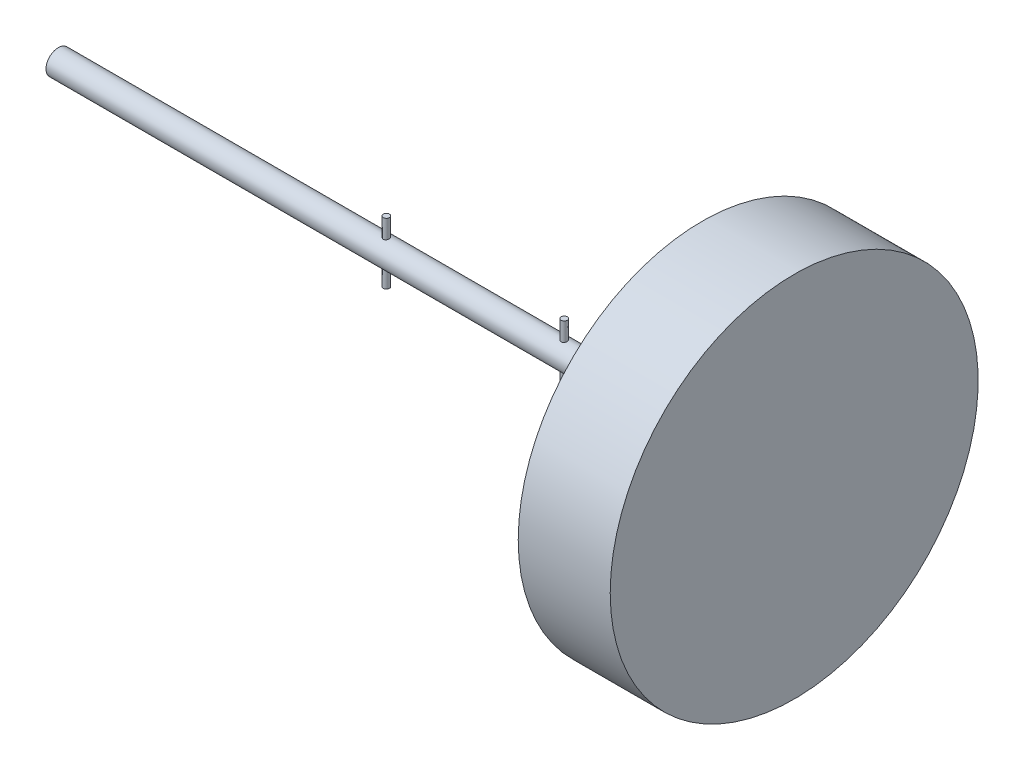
ISO-10303-21;
HEADER;
FILE_DESCRIPTION(('STEP AP214'),'2;1');
FILE_NAME('part.step','',(''),(''),'','','');
FILE_SCHEMA(('AUTOMOTIVE_DESIGN { 1 0 10303 214 1 1 1 1 }'));
ENDSEC;
DATA;
#1=APPLICATION_CONTEXT('core data for automotive mechanical design processes');
#2=APPLICATION_PROTOCOL_DEFINITION('international standard','automotive_design',2000,#1);
#3=PRODUCT_CONTEXT('',#1,'mechanical');
#4=PRODUCT('Part','Part','',(#3));
#5=PRODUCT_RELATED_PRODUCT_CATEGORY('part','',(#4));
#6=PRODUCT_DEFINITION_FORMATION('','',#4);
#7=PRODUCT_DEFINITION_CONTEXT('part definition',#1,'design');
#8=PRODUCT_DEFINITION('design','',#6,#7);
#9=PRODUCT_DEFINITION_SHAPE('','',#8);
#10=(LENGTH_UNIT() NAMED_UNIT(*) SI_UNIT(.MILLI.,.METRE.));
#11=(NAMED_UNIT(*) PLANE_ANGLE_UNIT() SI_UNIT($,.RADIAN.));
#12=(NAMED_UNIT(*) SI_UNIT($,.STERADIAN.) SOLID_ANGLE_UNIT());
#13=UNCERTAINTY_MEASURE_WITH_UNIT(LENGTH_MEASURE(1.E-05),#10,'distance_accuracy_value','');
#14=(GEOMETRIC_REPRESENTATION_CONTEXT(3) GLOBAL_UNCERTAINTY_ASSIGNED_CONTEXT((#13)) GLOBAL_UNIT_ASSIGNED_CONTEXT((#10,
#11,#12)) REPRESENTATION_CONTEXT('',''));
#15=CARTESIAN_POINT('',(0.,0.,0.));
#16=DIRECTION('',(0.,0.,1.));
#17=DIRECTION('',(1.,0.,0.));
#18=AXIS2_PLACEMENT_3D('',#15,#16,#17);
#19=CARTESIAN_POINT('',(-1125.,20.,0.));
#20=DIRECTION('',(1.,0.,0.));
#21=DIRECTION('',(0.,0.,-1.));
#22=AXIS2_PLACEMENT_3D('',#19,#20,#21);
#23=PLANE('',#22);
#24=CARTESIAN_POINT('',(-1125.,0.,0.));
#25=DIRECTION('',(-1.,0.,0.));
#26=DIRECTION('',(0.,0.,1.));
#27=AXIS2_PLACEMENT_3D('',#24,#25,#26);
#28=CIRCLE('',#27,20.);
#29=CARTESIAN_POINT('',(-1125.,0.,20.));
#30=VERTEX_POINT('',#29);
#31=EDGE_CURVE('E105',#30,#30,#28,.T.);
#32=ORIENTED_EDGE('',*,*,#31,.T.);
#33=EDGE_LOOP('',(#32));
#34=FACE_BOUND('',#33,.T.);
#35=ADVANCED_FACE('F28',(#34),#23,.F.);
#36=CARTESIAN_POINT('',(75.,0.,0.));
#37=DIRECTION('',(-1.,0.,0.));
#38=DIRECTION('',(0.,0.,1.));
#39=AXIS2_PLACEMENT_3D('',#36,#37,#38);
#40=PLANE('',#39);
#41=CARTESIAN_POINT('',(75.,0.,0.));
#42=DIRECTION('',(-1.,0.,0.));
#43=DIRECTION('',(0.,0.,1.));
#44=AXIS2_PLACEMENT_3D('',#41,#42,#43);
#45=CIRCLE('',#44,300.);
#46=CARTESIAN_POINT('',(75.,0.,300.));
#47=VERTEX_POINT('',#46);
#48=EDGE_CURVE('E10',#47,#47,#45,.T.);
#49=ORIENTED_EDGE('',*,*,#48,.F.);
#50=EDGE_LOOP('',(#49));
#51=FACE_BOUND('',#50,.T.);
#52=ADVANCED_FACE('F118',(#51),#40,.F.);
#53=CARTESIAN_POINT('',(-1125.,0.,0.));
#54=DIRECTION('',(-1.,0.,0.));
#55=DIRECTION('',(0.,0.,1.));
#56=AXIS2_PLACEMENT_3D('',#53,#54,#55);
#57=CYLINDRICAL_SURFACE('',#56,300.);
#58=CARTESIAN_POINT('',(-75.,0.,0.));
#59=DIRECTION('',(-1.,0.,0.));
#60=DIRECTION('',(0.,0.,1.));
#61=AXIS2_PLACEMENT_3D('',#58,#59,#60);
#62=CIRCLE('',#61,300.);
#63=CARTESIAN_POINT('',(-75.,0.,300.));
#64=VERTEX_POINT('',#63);
#65=EDGE_CURVE('E39',#64,#64,#62,.T.);
#66=ORIENTED_EDGE('',*,*,#65,.F.);
#67=EDGE_LOOP('',(#66));
#68=FACE_BOUND('',#67,.T.);
#69=ORIENTED_EDGE('',*,*,#48,.T.);
#70=EDGE_LOOP('',(#69));
#71=FACE_BOUND('',#70,.T.);
#72=ADVANCED_FACE('F114',(#68,#71),#57,.T.);
#73=CARTESIAN_POINT('',(-75.,300.,0.));
#74=DIRECTION('',(1.,0.,0.));
#75=DIRECTION('',(0.,0.,-1.));
#76=AXIS2_PLACEMENT_3D('',#73,#74,#75);
#77=PLANE('',#76);
#78=CARTESIAN_POINT('',(-75.,0.,0.));
#79=DIRECTION('',(-1.,0.,0.));
#80=DIRECTION('',(0.,0.,1.));
#81=AXIS2_PLACEMENT_3D('',#78,#79,#80);
#82=CIRCLE('',#81,20.0000000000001);
#83=CARTESIAN_POINT('',(-75.,0.,20.0000000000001));
#84=VERTEX_POINT('',#83);
#85=EDGE_CURVE('E44',#84,#84,#82,.T.);
#86=ORIENTED_EDGE('',*,*,#85,.F.);
#87=EDGE_LOOP('',(#86));
#88=FACE_BOUND('',#87,.T.);
#89=ORIENTED_EDGE('',*,*,#65,.T.);
#90=EDGE_LOOP('',(#89));
#91=FACE_BOUND('',#90,.T.);
#92=ADVANCED_FACE('F111',(#88,#91),#77,.F.);
#93=CARTESIAN_POINT('',(-1125.,0.,0.));
#94=DIRECTION('',(-1.,0.,0.));
#95=DIRECTION('',(0.,0.,1.));
#96=AXIS2_PLACEMENT_3D('',#93,#94,#95);
#97=CYLINDRICAL_SURFACE('',#96,20.0000000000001);
#98=CARTESIAN_POINT('',(-300.,-19.3649167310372,4.99999999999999));
#99=CARTESIAN_POINT('',(-299.723898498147,-19.3649220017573,4.99999215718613));
#100=CARTESIAN_POINT('',(-299.447710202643,-19.370886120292,4.97705249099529));
#101=CARTESIAN_POINT('',(-298.903264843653,-19.3940372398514,4.88604625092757));
#102=CARTESIAN_POINT('',(-298.635012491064,-19.4112307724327,4.8179534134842));
#103=CARTESIAN_POINT('',(-298.114392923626,-19.4547744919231,4.63898239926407));
#104=CARTESIAN_POINT('',(-297.862005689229,-19.4811128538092,4.52815945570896));
#105=CARTESIAN_POINT('',(-297.37937829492,-19.5399638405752,4.26704228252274));
#106=CARTESIAN_POINT('',(-297.14913907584,-19.5724767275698,4.11674637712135));
#107=CARTESIAN_POINT('',(-296.712276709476,-19.6408143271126,3.77741685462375));
#108=CARTESIAN_POINT('',(-296.5062127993,-19.6766919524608,3.58767377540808));
#109=CARTESIAN_POINT('',(-296.128477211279,-19.7472575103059,3.17636412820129));
#110=CARTESIAN_POINT('',(-295.956808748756,-19.7819453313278,2.95479458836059));
#111=CARTESIAN_POINT('',(-295.650449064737,-19.8468083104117,2.4822904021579));
#112=CARTESIAN_POINT('',(-295.516307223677,-19.8769137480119,2.23098915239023));
#113=CARTESIAN_POINT('',(-295.292380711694,-19.9286162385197,1.70852636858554));
#114=CARTESIAN_POINT('',(-295.202589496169,-19.950214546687,1.43736777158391));
#115=CARTESIAN_POINT('',(-295.071704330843,-19.9820951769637,0.888717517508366));
#116=CARTESIAN_POINT('',(-295.029660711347,-19.9925978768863,0.611465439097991));
#117=CARTESIAN_POINT('',(-294.992483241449,-20.0018718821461,0.0536576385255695));
#118=CARTESIAN_POINT('',(-294.997342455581,-20.0006449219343,-0.226897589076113));
#119=CARTESIAN_POINT('',(-295.0531497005,-19.9867618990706,-0.776761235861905));
#120=CARTESIAN_POINT('',(-295.103072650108,-19.974360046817,-1.04618107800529));
#121=CARTESIAN_POINT('',(-295.245942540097,-19.9398167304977,-1.57269123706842));
#122=CARTESIAN_POINT('',(-295.338891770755,-19.9176747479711,-1.82978089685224));
#123=CARTESIAN_POINT('',(-295.566005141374,-19.8657501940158,-2.32703351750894));
#124=CARTESIAN_POINT('',(-295.700534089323,-19.8359003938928,-2.56702254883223));
#125=CARTESIAN_POINT('',(-296.006711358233,-19.7717980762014,-3.02137811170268));
#126=CARTESIAN_POINT('',(-296.178366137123,-19.7375447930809,-3.2357401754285));
#127=CARTESIAN_POINT('',(-296.559417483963,-19.6672742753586,-3.63887017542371));
#128=CARTESIAN_POINT('',(-296.769709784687,-19.6312343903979,-3.82678839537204));
#129=CARTESIAN_POINT('',(-297.219199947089,-19.5623008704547,-4.16488187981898));
#130=CARTESIAN_POINT('',(-297.458399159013,-19.5294073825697,-4.31505538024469));
#131=CARTESIAN_POINT('',(-297.960580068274,-19.4704099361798,-4.57394064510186));
#132=CARTESIAN_POINT('',(-298.223671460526,-19.4443396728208,-4.68244783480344));
#133=CARTESIAN_POINT('',(-298.76517093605,-19.4023728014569,-4.85342810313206));
#134=CARTESIAN_POINT('',(-299.043575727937,-19.3864740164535,-4.91591103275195));
#135=CARTESIAN_POINT('',(-299.599919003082,-19.3671071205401,-4.99165927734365));
#136=CARTESIAN_POINT('',(-299.877675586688,-19.3633217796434,-5.00618094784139));
#137=CARTESIAN_POINT('',(-300.431643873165,-19.3677468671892,-4.98903398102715));
#138=CARTESIAN_POINT('',(-300.707855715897,-19.3759561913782,-4.95736959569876));
#139=CARTESIAN_POINT('',(-301.246228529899,-19.403141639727,-4.84985092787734));
#140=CARTESIAN_POINT('',(-301.508545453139,-19.421939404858,-4.77472813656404));
#141=CARTESIAN_POINT('',(-302.016862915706,-19.4680143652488,-4.58323616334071));
#142=CARTESIAN_POINT('',(-302.262861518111,-19.4952925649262,-4.46686209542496));
#143=CARTESIAN_POINT('',(-302.736882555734,-19.5559227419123,-4.19354133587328));
#144=CARTESIAN_POINT('',(-302.964457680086,-19.5893833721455,-4.03584350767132));
#145=CARTESIAN_POINT('',(-303.390376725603,-19.6583416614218,-3.68530146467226));
#146=CARTESIAN_POINT('',(-303.5887158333,-19.6938396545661,-3.4924514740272));
#147=CARTESIAN_POINT('',(-303.955622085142,-19.7639480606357,-3.07131360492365));
#148=CARTESIAN_POINT('',(-304.123320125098,-19.7985140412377,-2.84225976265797));
#149=CARTESIAN_POINT('',(-304.417871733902,-19.8619443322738,-2.35851341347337));
#150=CARTESIAN_POINT('',(-304.544727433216,-19.890808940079,-2.10382224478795));
#151=CARTESIAN_POINT('',(-304.752892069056,-19.9394023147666,-1.57779100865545));
#152=CARTESIAN_POINT('',(-304.834528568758,-19.9591966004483,-1.30658690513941));
#153=CARTESIAN_POINT('',(-304.950920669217,-19.9877058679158,-0.753748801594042));
#154=CARTESIAN_POINT('',(-304.985685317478,-19.9964229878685,-0.472116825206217));
#155=CARTESIAN_POINT('',(-305.006837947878,-20.0017084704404,0.0854176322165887));
#156=CARTESIAN_POINT('',(-304.994508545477,-19.9985989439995,0.361269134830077));
#157=CARTESIAN_POINT('',(-304.924760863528,-19.9812948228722,0.906837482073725));
#158=CARTESIAN_POINT('',(-304.867343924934,-19.9671005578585,1.17655450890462));
#159=CARTESIAN_POINT('',(-304.709738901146,-19.9292716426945,1.70085517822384));
#160=CARTESIAN_POINT('',(-304.609782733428,-19.9056882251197,1.95551247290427));
#161=CARTESIAN_POINT('',(-304.370147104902,-19.851564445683,2.44458526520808));
#162=CARTESIAN_POINT('',(-304.230462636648,-19.8210232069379,2.67899820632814));
#163=CARTESIAN_POINT('',(-303.911423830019,-19.7553624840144,3.12700964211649));
#164=CARTESIAN_POINT('',(-303.731199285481,-19.7201508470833,3.33997494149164));
#165=CARTESIAN_POINT('',(-303.337885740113,-19.6495324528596,3.73307510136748));
#166=CARTESIAN_POINT('',(-303.124788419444,-19.6141256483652,3.91320162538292));
#167=CARTESIAN_POINT('',(-302.666992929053,-19.5463737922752,4.23881013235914));
#168=CARTESIAN_POINT('',(-302.421779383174,-19.5140981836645,4.38358309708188));
#169=CARTESIAN_POINT('',(-301.909722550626,-19.4571977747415,4.62963448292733));
#170=CARTESIAN_POINT('',(-301.642895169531,-19.4325674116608,4.73094454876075));
#171=CARTESIAN_POINT('',(-301.147114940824,-19.3975954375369,4.872112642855));
#172=CARTESIAN_POINT('',(-300.920534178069,-19.385433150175,4.91996585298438));
#173=CARTESIAN_POINT('',(-300.462655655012,-19.3690919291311,4.98391146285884));
#174=CARTESIAN_POINT('',(-300.231358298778,-19.3649123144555,5.00000657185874));
#175=CARTESIAN_POINT('',(-300.,-19.3649167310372,4.99999999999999));
#176=B_SPLINE_CURVE_WITH_KNOTS('',3,(#98,#99,#100,#101,#102,#103,#104,#105,#106,#107,#108,#109,
#110,#111,#112,#113,#114,#115,#116,#117,#118,#119,#120,#121,#122,#123,#124,#125,#126,#127,#128,
#129,#130,#131,#132,#133,#134,#135,#136,#137,#138,#139,#140,#141,#142,#143,#144,#145,#146,#147,
#148,#149,#150,#151,#152,#153,#154,#155,#156,#157,#158,#159,#160,#161,#162,#163,#164,#165,#166,
#167,#168,#169,#170,#171,#172,#173,#174,#175),.UNSPECIFIED.,.T.,.F.,(4,2,2,2,2,2,2,2,2,2,2,2,2,
2,2,2,2,2,2,2,2,2,2,2,2,2,2,2,2,2,2,2,2,2,2,2,2,2,4),(0.,0.827454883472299,1.65539148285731,
2.4822614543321,3.30916653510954,4.15247908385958,4.99587042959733,5.85102992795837,
6.70606319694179,7.54377501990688,8.38136297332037,9.2003652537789,10.0194111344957,
10.8458574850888,11.6724477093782,12.5214093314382,13.370410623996,14.2235286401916,
15.0764640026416,15.9068714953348,16.7372025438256,17.5539481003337,18.3707904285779,
19.2036569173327,20.0366603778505,20.8905066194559,21.7443083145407,22.5918414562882,
23.4392109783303,24.2636689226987,25.0881023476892,25.9080975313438,26.728196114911,
27.567941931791,28.4079006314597,29.2635295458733,30.118534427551,30.8119565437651,
31.505319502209),.UNSPECIFIED.);
#177=CARTESIAN_POINT('',(-300.,-19.3649167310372,4.99999999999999));
#178=VERTEX_POINT('',#177);
#179=EDGE_CURVE('E31',#178,#178,#176,.T.);
#180=ORIENTED_EDGE('',*,*,#179,.T.);
#181=EDGE_LOOP('',(#180));
#182=FACE_BOUND('',#181,.T.);
#183=CARTESIAN_POINT('',(-300.,19.3649167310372,4.99999999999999));
#184=CARTESIAN_POINT('',(-300.276101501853,19.3649220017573,4.99999215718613));
#185=CARTESIAN_POINT('',(-300.552289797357,19.370886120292,4.97705249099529));
#186=CARTESIAN_POINT('',(-301.096735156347,19.3940372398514,4.88604625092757));
#187=CARTESIAN_POINT('',(-301.364987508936,19.4112307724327,4.8179534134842));
#188=CARTESIAN_POINT('',(-301.885607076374,19.4547744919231,4.63898239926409));
#189=CARTESIAN_POINT('',(-302.137994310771,19.4811128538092,4.52815945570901));
#190=CARTESIAN_POINT('',(-302.62062170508,19.5399638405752,4.26704228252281));
#191=CARTESIAN_POINT('',(-302.85086092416,19.5724767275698,4.1167463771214));
#192=CARTESIAN_POINT('',(-303.287723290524,19.6408143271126,3.77741685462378));
#193=CARTESIAN_POINT('',(-303.4937872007,19.6766919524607,3.58767377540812));
#194=CARTESIAN_POINT('',(-303.871522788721,19.7472575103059,3.17636412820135));
#195=CARTESIAN_POINT('',(-304.043191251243,19.7819453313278,2.95479458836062));
#196=CARTESIAN_POINT('',(-304.349550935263,19.8468083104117,2.4822904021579));
#197=CARTESIAN_POINT('',(-304.483692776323,19.8769137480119,2.23098915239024));
#198=CARTESIAN_POINT('',(-304.707619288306,19.9286162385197,1.70852636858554));
#199=CARTESIAN_POINT('',(-304.797410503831,19.950214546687,1.43736777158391));
#200=CARTESIAN_POINT('',(-304.928295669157,19.9820951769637,0.888717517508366));
#201=CARTESIAN_POINT('',(-304.970339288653,19.9925978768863,0.611465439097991));
#202=CARTESIAN_POINT('',(-305.007516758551,20.0018718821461,0.0536576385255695));
#203=CARTESIAN_POINT('',(-305.002657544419,20.0006449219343,-0.226897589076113));
#204=CARTESIAN_POINT('',(-304.9468502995,19.9867618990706,-0.776761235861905));
#205=CARTESIAN_POINT('',(-304.896927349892,19.974360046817,-1.04618107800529));
#206=CARTESIAN_POINT('',(-304.754057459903,19.9398167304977,-1.57269123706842));
#207=CARTESIAN_POINT('',(-304.661108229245,19.9176747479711,-1.82978089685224));
#208=CARTESIAN_POINT('',(-304.433994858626,19.8657501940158,-2.32703351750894));
#209=CARTESIAN_POINT('',(-304.299465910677,19.8359003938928,-2.56702254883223));
#210=CARTESIAN_POINT('',(-303.993288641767,19.7717980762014,-3.02137811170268));
#211=CARTESIAN_POINT('',(-303.821633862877,19.7375447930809,-3.2357401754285));
#212=CARTESIAN_POINT('',(-303.440582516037,19.6672742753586,-3.63887017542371));
#213=CARTESIAN_POINT('',(-303.230290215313,19.6312343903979,-3.82678839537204));
#214=CARTESIAN_POINT('',(-302.780800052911,19.5623008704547,-4.16488187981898));
#215=CARTESIAN_POINT('',(-302.541600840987,19.5294073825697,-4.31505538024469));
#216=CARTESIAN_POINT('',(-302.039419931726,19.4704099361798,-4.57394064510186));
#217=CARTESIAN_POINT('',(-301.776328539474,19.4443396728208,-4.68244783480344));
#218=CARTESIAN_POINT('',(-301.23482906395,19.4023728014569,-4.85342810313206));
#219=CARTESIAN_POINT('',(-300.956424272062,19.3864740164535,-4.91591103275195));
#220=CARTESIAN_POINT('',(-300.400080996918,19.3671071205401,-4.99165927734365));
#221=CARTESIAN_POINT('',(-300.122324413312,19.3633217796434,-5.00618094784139));
#222=CARTESIAN_POINT('',(-299.568356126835,19.3677468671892,-4.98903398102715));
#223=CARTESIAN_POINT('',(-299.292144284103,19.3759561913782,-4.95736959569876));
#224=CARTESIAN_POINT('',(-298.753771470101,19.403141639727,-4.84985092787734));
#225=CARTESIAN_POINT('',(-298.491454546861,19.421939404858,-4.77472813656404));
#226=CARTESIAN_POINT('',(-297.983137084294,19.4680143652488,-4.58323616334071));
#227=CARTESIAN_POINT('',(-297.737138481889,19.4952925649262,-4.46686209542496));
#228=CARTESIAN_POINT('',(-297.263117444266,19.5559227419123,-4.19354133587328));
#229=CARTESIAN_POINT('',(-297.035542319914,19.5893833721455,-4.03584350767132));
#230=CARTESIAN_POINT('',(-296.609623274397,19.6583416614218,-3.68530146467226));
#231=CARTESIAN_POINT('',(-296.4112841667,19.6938396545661,-3.4924514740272));
#232=CARTESIAN_POINT('',(-296.044377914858,19.7639480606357,-3.07131360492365));
#233=CARTESIAN_POINT('',(-295.876679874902,19.7985140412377,-2.84225976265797));
#234=CARTESIAN_POINT('',(-295.582128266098,19.8619443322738,-2.35851341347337));
#235=CARTESIAN_POINT('',(-295.455272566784,19.890808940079,-2.10382224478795));
#236=CARTESIAN_POINT('',(-295.247107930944,19.9394023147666,-1.57779100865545));
#237=CARTESIAN_POINT('',(-295.165471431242,19.9591966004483,-1.30658690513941));
#238=CARTESIAN_POINT('',(-295.049079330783,19.9877058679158,-0.753748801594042));
#239=CARTESIAN_POINT('',(-295.014314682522,19.9964229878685,-0.472116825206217));
#240=CARTESIAN_POINT('',(-294.993162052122,20.0017084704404,0.0854176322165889));
#241=CARTESIAN_POINT('',(-295.005491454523,19.9985989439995,0.361269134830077));
#242=CARTESIAN_POINT('',(-295.075239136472,19.9812948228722,0.906837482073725));
#243=CARTESIAN_POINT('',(-295.132656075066,19.9671005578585,1.17655450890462));
#244=CARTESIAN_POINT('',(-295.290261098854,19.9292716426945,1.70085517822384));
#245=CARTESIAN_POINT('',(-295.390217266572,19.9056882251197,1.95551247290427));
#246=CARTESIAN_POINT('',(-295.629852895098,19.851564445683,2.44458526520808));
#247=CARTESIAN_POINT('',(-295.769537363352,19.8210232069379,2.67899820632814));
#248=CARTESIAN_POINT('',(-296.088576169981,19.7553624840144,3.12700964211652));
#249=CARTESIAN_POINT('',(-296.268800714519,19.7201508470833,3.3399749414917));
#250=CARTESIAN_POINT('',(-296.662114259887,19.6495324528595,3.73307510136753));
#251=CARTESIAN_POINT('',(-296.875211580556,19.6141256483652,3.91320162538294));
#252=CARTESIAN_POINT('',(-297.333007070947,19.5463737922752,4.23881013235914));
#253=CARTESIAN_POINT('',(-297.578220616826,19.5140981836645,4.38358309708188));
#254=CARTESIAN_POINT('',(-298.090277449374,19.4571977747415,4.62963448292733));
#255=CARTESIAN_POINT('',(-298.357104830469,19.4325674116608,4.73094454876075));
#256=CARTESIAN_POINT('',(-298.852885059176,19.3975954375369,4.872112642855));
#257=CARTESIAN_POINT('',(-299.079465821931,19.385433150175,4.91996585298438));
#258=CARTESIAN_POINT('',(-299.537344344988,19.3690919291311,4.98391146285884));
#259=CARTESIAN_POINT('',(-299.768641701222,19.3649123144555,5.00000657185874));
#260=CARTESIAN_POINT('',(-300.,19.3649167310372,4.99999999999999));
#261=B_SPLINE_CURVE_WITH_KNOTS('',3,(#183,#184,#185,#186,#187,#188,#189,#190,#191,#192,#193,
#194,#195,#196,#197,#198,#199,#200,#201,#202,#203,#204,#205,#206,#207,#208,#209,#210,#211,#212,
#213,#214,#215,#216,#217,#218,#219,#220,#221,#222,#223,#224,#225,#226,#227,#228,#229,#230,#231,
#232,#233,#234,#235,#236,#237,#238,#239,#240,#241,#242,#243,#244,#245,#246,#247,#248,#249,#250,
#251,#252,#253,#254,#255,#256,#257,#258,#259,#260),.UNSPECIFIED.,.T.,.F.,(4,2,2,2,2,2,2,2,2,2,2,
2,2,2,2,2,2,2,2,2,2,2,2,2,2,2,2,2,2,2,2,2,2,2,2,2,2,2,4),(0.,0.827454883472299,1.65539148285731,
2.48226145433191,3.30916653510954,4.15247908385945,4.99587042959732,5.85102992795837,
6.70606319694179,7.54377501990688,8.38136297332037,9.2003652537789,10.0194111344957,
10.8458574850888,11.6724477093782,12.5214093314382,13.370410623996,14.2235286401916,
15.0764640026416,15.9068714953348,16.7372025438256,17.5539481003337,18.3707904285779,
19.2036569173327,20.0366603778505,20.8905066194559,21.7443083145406,22.5918414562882,
23.4392109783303,24.2636689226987,25.0881023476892,25.9080975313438,26.728196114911,
27.5679419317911,28.4079006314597,29.2635295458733,30.118534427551,30.8119565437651,
31.505319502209),.UNSPECIFIED.);
#262=CARTESIAN_POINT('',(-300.,19.3649167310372,4.99999999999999));
#263=VERTEX_POINT('',#262);
#264=EDGE_CURVE('E85',#263,#263,#261,.T.);
#265=ORIENTED_EDGE('',*,*,#264,.T.);
#266=EDGE_LOOP('',(#265));
#267=FACE_BOUND('',#266,.T.);
#268=CARTESIAN_POINT('',(-590.,-19.3649167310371,5.00000000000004));
#269=CARTESIAN_POINT('',(-589.723898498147,-19.3649220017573,4.99999215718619));
#270=CARTESIAN_POINT('',(-589.447710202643,-19.370886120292,4.97705249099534));
#271=CARTESIAN_POINT('',(-588.903264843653,-19.3940372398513,4.88604625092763));
#272=CARTESIAN_POINT('',(-588.635012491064,-19.4112307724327,4.81795341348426));
#273=CARTESIAN_POINT('',(-588.114392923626,-19.4547744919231,4.63898239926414));
#274=CARTESIAN_POINT('',(-587.862005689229,-19.4811128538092,4.52815945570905));
#275=CARTESIAN_POINT('',(-587.37937829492,-19.5399638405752,4.26704228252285));
#276=CARTESIAN_POINT('',(-587.14913907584,-19.5724767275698,4.11674637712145));
#277=CARTESIAN_POINT('',(-586.712276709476,-19.6408143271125,3.77741685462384));
#278=CARTESIAN_POINT('',(-586.5062127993,-19.6766919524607,3.58767377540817));
#279=CARTESIAN_POINT('',(-586.128477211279,-19.7472575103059,3.1763641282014));
#280=CARTESIAN_POINT('',(-585.956808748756,-19.7819453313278,2.9547945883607));
#281=CARTESIAN_POINT('',(-585.650449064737,-19.8468083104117,2.482290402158));
#282=CARTESIAN_POINT('',(-585.516307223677,-19.8769137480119,2.23098915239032));
#283=CARTESIAN_POINT('',(-585.292380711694,-19.9286162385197,1.7085263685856));
#284=CARTESIAN_POINT('',(-585.202589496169,-19.950214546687,1.43736777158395));
#285=CARTESIAN_POINT('',(-585.071704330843,-19.9820951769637,0.888717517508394));
#286=CARTESIAN_POINT('',(-585.029660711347,-19.9925978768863,0.611465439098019));
#287=CARTESIAN_POINT('',(-584.992483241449,-20.0018718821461,0.0536576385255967));
#288=CARTESIAN_POINT('',(-584.997342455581,-20.0006449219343,-0.226897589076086));
#289=CARTESIAN_POINT('',(-585.0531497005,-19.9867618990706,-0.776761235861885));
#290=CARTESIAN_POINT('',(-585.103072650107,-19.974360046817,-1.04618107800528));
#291=CARTESIAN_POINT('',(-585.245942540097,-19.9398167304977,-1.57269123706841));
#292=CARTESIAN_POINT('',(-585.338891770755,-19.9176747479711,-1.82978089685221));
#293=CARTESIAN_POINT('',(-585.566005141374,-19.8657501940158,-2.32703351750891));
#294=CARTESIAN_POINT('',(-585.700534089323,-19.8359003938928,-2.56702254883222));
#295=CARTESIAN_POINT('',(-586.006711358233,-19.7717980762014,-3.02137811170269));
#296=CARTESIAN_POINT('',(-586.178366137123,-19.7375447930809,-3.23574017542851));
#297=CARTESIAN_POINT('',(-586.559417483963,-19.6672742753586,-3.63887017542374));
#298=CARTESIAN_POINT('',(-586.769709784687,-19.6312343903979,-3.8267883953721));
#299=CARTESIAN_POINT('',(-587.219199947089,-19.5623008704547,-4.16488187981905));
#300=CARTESIAN_POINT('',(-587.458399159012,-19.5294073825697,-4.31505538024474));
#301=CARTESIAN_POINT('',(-587.960580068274,-19.4704099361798,-4.57394064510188));
#302=CARTESIAN_POINT('',(-588.223671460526,-19.4443396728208,-4.68244783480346));
#303=CARTESIAN_POINT('',(-588.76517093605,-19.4023728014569,-4.85342810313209));
#304=CARTESIAN_POINT('',(-589.043575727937,-19.3864740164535,-4.915911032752));
#305=CARTESIAN_POINT('',(-589.599919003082,-19.3671071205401,-4.9916592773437));
#306=CARTESIAN_POINT('',(-589.877675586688,-19.3633217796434,-5.00618094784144));
#307=CARTESIAN_POINT('',(-590.431643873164,-19.3677468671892,-4.98903398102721));
#308=CARTESIAN_POINT('',(-590.707855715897,-19.3759561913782,-4.95736959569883));
#309=CARTESIAN_POINT('',(-591.246228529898,-19.403141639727,-4.84985092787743));
#310=CARTESIAN_POINT('',(-591.508545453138,-19.421939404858,-4.77472813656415));
#311=CARTESIAN_POINT('',(-592.016862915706,-19.4680143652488,-4.58323616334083));
#312=CARTESIAN_POINT('',(-592.262861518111,-19.4952925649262,-4.46686209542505));
#313=CARTESIAN_POINT('',(-592.736882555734,-19.5559227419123,-4.19354133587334));
#314=CARTESIAN_POINT('',(-592.964457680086,-19.5893833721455,-4.03584350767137));
#315=CARTESIAN_POINT('',(-593.390376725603,-19.6583416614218,-3.68530146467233));
#316=CARTESIAN_POINT('',(-593.5887158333,-19.693839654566,-3.49245147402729));
#317=CARTESIAN_POINT('',(-593.955622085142,-19.7639480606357,-3.07131360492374));
#318=CARTESIAN_POINT('',(-594.123320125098,-19.7985140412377,-2.84225976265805));
#319=CARTESIAN_POINT('',(-594.417871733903,-19.8619443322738,-2.35851341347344));
#320=CARTESIAN_POINT('',(-594.544727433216,-19.890808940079,-2.10382224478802));
#321=CARTESIAN_POINT('',(-594.752892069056,-19.9394023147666,-1.57779100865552));
#322=CARTESIAN_POINT('',(-594.834528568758,-19.9591966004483,-1.30658690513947));
#323=CARTESIAN_POINT('',(-594.950920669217,-19.9877058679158,-0.753748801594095));
#324=CARTESIAN_POINT('',(-594.985685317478,-19.9964229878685,-0.472116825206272));
#325=CARTESIAN_POINT('',(-595.006837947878,-20.0017084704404,0.0854176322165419));
#326=CARTESIAN_POINT('',(-594.994508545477,-19.9985989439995,0.361269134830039));
#327=CARTESIAN_POINT('',(-594.924760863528,-19.9812948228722,0.90683748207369));
#328=CARTESIAN_POINT('',(-594.867343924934,-19.9671005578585,1.17655450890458));
#329=CARTESIAN_POINT('',(-594.709738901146,-19.9292716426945,1.70085517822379));
#330=CARTESIAN_POINT('',(-594.609782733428,-19.9056882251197,1.95551247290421));
#331=CARTESIAN_POINT('',(-594.370147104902,-19.851564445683,2.44458526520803));
#332=CARTESIAN_POINT('',(-594.230462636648,-19.821023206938,2.67899820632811));
#333=CARTESIAN_POINT('',(-593.911423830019,-19.7553624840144,3.12700964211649));
#334=CARTESIAN_POINT('',(-593.731199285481,-19.7201508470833,3.33997494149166));
#335=CARTESIAN_POINT('',(-593.337885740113,-19.6495324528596,3.7330751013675));
#336=CARTESIAN_POINT('',(-593.124788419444,-19.6141256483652,3.91320162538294));
#337=CARTESIAN_POINT('',(-592.666992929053,-19.5463737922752,4.23881013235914));
#338=CARTESIAN_POINT('',(-592.421779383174,-19.5140981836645,4.38358309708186));
#339=CARTESIAN_POINT('',(-591.909722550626,-19.4571977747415,4.62963448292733));
#340=CARTESIAN_POINT('',(-591.642895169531,-19.4325674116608,4.73094454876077));
#341=CARTESIAN_POINT('',(-591.147114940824,-19.3975954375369,4.87211264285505));
#342=CARTESIAN_POINT('',(-590.920534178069,-19.385433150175,4.91996585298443));
#343=CARTESIAN_POINT('',(-590.462655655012,-19.3690919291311,4.98391146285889));
#344=CARTESIAN_POINT('',(-590.231358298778,-19.3649123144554,5.0000065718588));
#345=CARTESIAN_POINT('',(-590.,-19.3649167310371,5.00000000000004));
#346=B_SPLINE_CURVE_WITH_KNOTS('',3,(#268,#269,#270,#271,#272,#273,#274,#275,#276,#277,#278,
#279,#280,#281,#282,#283,#284,#285,#286,#287,#288,#289,#290,#291,#292,#293,#294,#295,#296,#297,
#298,#299,#300,#301,#302,#303,#304,#305,#306,#307,#308,#309,#310,#311,#312,#313,#314,#315,#316,
#317,#318,#319,#320,#321,#322,#323,#324,#325,#326,#327,#328,#329,#330,#331,#332,#333,#334,#335,
#336,#337,#338,#339,#340,#341,#342,#343,#344,#345),.UNSPECIFIED.,.T.,.F.,(4,2,2,2,2,2,2,2,2,2,2,
2,2,2,2,2,2,2,2,2,2,2,2,2,2,2,2,2,2,2,2,2,2,2,2,2,2,2,4),(0.,0.827454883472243,1.65539148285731,
2.48226145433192,3.30916653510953,4.1524790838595,4.99587042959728,5.8510299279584,
6.70606319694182,7.54377501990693,8.38136297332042,9.20036525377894,10.0194111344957,
10.8458574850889,11.6724477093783,12.5214093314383,13.3704106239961,14.2235286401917,
15.0764640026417,15.9068714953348,16.7372025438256,17.5539481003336,18.370790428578,
19.2036569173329,20.0366603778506,20.8905066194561,21.7443083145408,22.5918414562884,
23.4392109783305,24.2636689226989,25.0881023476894,25.9080975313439,26.7281961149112,
27.5679419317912,28.40790063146,29.2635295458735,30.1185344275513,30.8119565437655,
31.5053195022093),.UNSPECIFIED.);
#347=CARTESIAN_POINT('',(-590.,-19.3649167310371,5.00000000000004));
#348=VERTEX_POINT('',#347);
#349=EDGE_CURVE('E54',#348,#348,#346,.T.);
#350=ORIENTED_EDGE('',*,*,#349,.T.);
#351=EDGE_LOOP('',(#350));
#352=FACE_BOUND('',#351,.T.);
#353=CARTESIAN_POINT('',(-590.,19.3649167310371,5.00000000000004));
#354=CARTESIAN_POINT('',(-590.276101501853,19.3649220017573,4.99999215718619));
#355=CARTESIAN_POINT('',(-590.552289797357,19.370886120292,4.97705249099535));
#356=CARTESIAN_POINT('',(-591.096735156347,19.3940372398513,4.88604625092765));
#357=CARTESIAN_POINT('',(-591.364987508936,19.4112307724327,4.81795341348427));
#358=CARTESIAN_POINT('',(-591.885607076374,19.4547744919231,4.63898239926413));
#359=CARTESIAN_POINT('',(-592.137994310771,19.4811128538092,4.52815945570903));
#360=CARTESIAN_POINT('',(-592.62062170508,19.5399638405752,4.26704228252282));
#361=CARTESIAN_POINT('',(-592.85086092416,19.5724767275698,4.11674637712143));
#362=CARTESIAN_POINT('',(-593.287723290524,19.6408143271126,3.77741685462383));
#363=CARTESIAN_POINT('',(-593.4937872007,19.6766919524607,3.58767377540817));
#364=CARTESIAN_POINT('',(-593.871522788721,19.7472575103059,3.1763641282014));
#365=CARTESIAN_POINT('',(-594.043191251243,19.7819453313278,2.9547945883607));
#366=CARTESIAN_POINT('',(-594.349550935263,19.8468083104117,2.48229040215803));
#367=CARTESIAN_POINT('',(-594.483692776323,19.8769137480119,2.23098915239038));
#368=CARTESIAN_POINT('',(-594.707619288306,19.9286162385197,1.70852636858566));
#369=CARTESIAN_POINT('',(-594.797410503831,19.950214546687,1.43736777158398));
#370=CARTESIAN_POINT('',(-594.928295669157,19.9820951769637,0.888717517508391));
#371=CARTESIAN_POINT('',(-594.970339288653,19.9925978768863,0.611465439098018));
#372=CARTESIAN_POINT('',(-595.007516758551,20.0018718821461,0.0536576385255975));
#373=CARTESIAN_POINT('',(-595.002657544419,20.0006449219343,-0.226897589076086));
#374=CARTESIAN_POINT('',(-594.9468502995,19.9867618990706,-0.776761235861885));
#375=CARTESIAN_POINT('',(-594.896927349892,19.974360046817,-1.04618107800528));
#376=CARTESIAN_POINT('',(-594.754057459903,19.9398167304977,-1.57269123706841));
#377=CARTESIAN_POINT('',(-594.661108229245,19.9176747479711,-1.82978089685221));
#378=CARTESIAN_POINT('',(-594.433994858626,19.8657501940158,-2.32703351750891));
#379=CARTESIAN_POINT('',(-594.299465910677,19.8359003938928,-2.56702254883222));
#380=CARTESIAN_POINT('',(-593.993288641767,19.7717980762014,-3.02137811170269));
#381=CARTESIAN_POINT('',(-593.821633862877,19.7375447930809,-3.23574017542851));
#382=CARTESIAN_POINT('',(-593.440582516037,19.6672742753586,-3.63887017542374));
#383=CARTESIAN_POINT('',(-593.230290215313,19.6312343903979,-3.8267883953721));
#384=CARTESIAN_POINT('',(-592.780800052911,19.5623008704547,-4.16488187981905));
#385=CARTESIAN_POINT('',(-592.541600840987,19.5294073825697,-4.31505538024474));
#386=CARTESIAN_POINT('',(-592.039419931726,19.4704099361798,-4.57394064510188));
#387=CARTESIAN_POINT('',(-591.776328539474,19.4443396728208,-4.68244783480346));
#388=CARTESIAN_POINT('',(-591.23482906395,19.4023728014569,-4.85342810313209));
#389=CARTESIAN_POINT('',(-590.956424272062,19.3864740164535,-4.915911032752));
#390=CARTESIAN_POINT('',(-590.400080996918,19.3671071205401,-4.9916592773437));
#391=CARTESIAN_POINT('',(-590.122324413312,19.3633217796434,-5.00618094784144));
#392=CARTESIAN_POINT('',(-589.568356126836,19.3677468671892,-4.98903398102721));
#393=CARTESIAN_POINT('',(-589.292144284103,19.3759561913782,-4.95736959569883));
#394=CARTESIAN_POINT('',(-588.753771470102,19.403141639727,-4.84985092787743));
#395=CARTESIAN_POINT('',(-588.491454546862,19.421939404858,-4.77472813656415));
#396=CARTESIAN_POINT('',(-587.983137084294,19.4680143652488,-4.58323616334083));
#397=CARTESIAN_POINT('',(-587.737138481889,19.4952925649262,-4.46686209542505));
#398=CARTESIAN_POINT('',(-587.263117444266,19.5559227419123,-4.19354133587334));
#399=CARTESIAN_POINT('',(-587.035542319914,19.5893833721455,-4.03584350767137));
#400=CARTESIAN_POINT('',(-586.609623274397,19.6583416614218,-3.68530146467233));
#401=CARTESIAN_POINT('',(-586.4112841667,19.693839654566,-3.49245147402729));
#402=CARTESIAN_POINT('',(-586.044377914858,19.7639480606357,-3.07131360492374));
#403=CARTESIAN_POINT('',(-585.876679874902,19.7985140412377,-2.84225976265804));
#404=CARTESIAN_POINT('',(-585.582128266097,19.8619443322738,-2.35851341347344));
#405=CARTESIAN_POINT('',(-585.455272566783,19.890808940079,-2.10382224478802));
#406=CARTESIAN_POINT('',(-585.247107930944,19.9394023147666,-1.57779100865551));
#407=CARTESIAN_POINT('',(-585.165471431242,19.9591966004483,-1.30658690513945));
#408=CARTESIAN_POINT('',(-585.049079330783,19.9877058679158,-0.753748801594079));
#409=CARTESIAN_POINT('',(-585.014314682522,19.9964229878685,-0.472116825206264));
#410=CARTESIAN_POINT('',(-584.993162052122,20.0017084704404,0.0854176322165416));
#411=CARTESIAN_POINT('',(-585.005491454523,19.9985989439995,0.361269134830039));
#412=CARTESIAN_POINT('',(-585.075239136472,19.9812948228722,0.90683748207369));
#413=CARTESIAN_POINT('',(-585.132656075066,19.9671005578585,1.17655450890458));
#414=CARTESIAN_POINT('',(-585.290261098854,19.9292716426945,1.70085517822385));
#415=CARTESIAN_POINT('',(-585.390217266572,19.9056882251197,1.95551247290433));
#416=CARTESIAN_POINT('',(-585.629852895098,19.851564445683,2.44458526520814));
#417=CARTESIAN_POINT('',(-585.769537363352,19.8210232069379,2.67899820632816));
#418=CARTESIAN_POINT('',(-586.088576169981,19.7553624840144,3.12700964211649));
#419=CARTESIAN_POINT('',(-586.268800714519,19.7201508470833,3.33997494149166));
#420=CARTESIAN_POINT('',(-586.662114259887,19.6495324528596,3.7330751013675));
#421=CARTESIAN_POINT('',(-586.875211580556,19.6141256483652,3.91320162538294));
#422=CARTESIAN_POINT('',(-587.333007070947,19.5463737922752,4.23881013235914));
#423=CARTESIAN_POINT('',(-587.578220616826,19.5140981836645,4.38358309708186));
#424=CARTESIAN_POINT('',(-588.090277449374,19.4571977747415,4.62963448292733));
#425=CARTESIAN_POINT('',(-588.357104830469,19.4325674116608,4.73094454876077));
#426=CARTESIAN_POINT('',(-588.852885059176,19.3975954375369,4.87211264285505));
#427=CARTESIAN_POINT('',(-589.079465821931,19.385433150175,4.91996585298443));
#428=CARTESIAN_POINT('',(-589.537344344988,19.3690919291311,4.98391146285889));
#429=CARTESIAN_POINT('',(-589.768641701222,19.3649123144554,5.0000065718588));
#430=CARTESIAN_POINT('',(-590.,19.3649167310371,5.00000000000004));
#431=B_SPLINE_CURVE_WITH_KNOTS('',3,(#353,#354,#355,#356,#357,#358,#359,#360,#361,#362,#363,
#364,#365,#366,#367,#368,#369,#370,#371,#372,#373,#374,#375,#376,#377,#378,#379,#380,#381,#382,
#383,#384,#385,#386,#387,#388,#389,#390,#391,#392,#393,#394,#395,#396,#397,#398,#399,#400,#401,
#402,#403,#404,#405,#406,#407,#408,#409,#410,#411,#412,#413,#414,#415,#416,#417,#418,#419,#420,
#421,#422,#423,#424,#425,#426,#427,#428,#429,#430),.UNSPECIFIED.,.T.,.F.,(4,2,2,2,2,2,2,2,2,2,2,
2,2,2,2,2,2,2,2,2,2,2,2,2,2,2,2,2,2,2,2,2,2,2,2,2,2,2,4),(0.,0.82745488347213,1.65539148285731,
2.48226145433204,3.30916653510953,4.15247908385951,4.99587042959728,5.85102992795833,
6.70606319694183,7.54377501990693,8.38136297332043,9.20036525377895,10.0194111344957,
10.8458574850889,11.6724477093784,12.5214093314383,13.3704106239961,14.2235286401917,
15.0764640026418,15.9068714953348,16.7372025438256,17.5539481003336,18.3707904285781,
19.2036569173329,20.0366603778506,20.8905066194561,21.7443083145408,22.5918414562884,
23.4392109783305,24.2636689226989,25.0881023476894,25.9080975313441,26.7281961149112,
27.5679419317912,28.40790063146,29.2635295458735,30.1185344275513,30.8119565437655,
31.5053195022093),.UNSPECIFIED.);
#432=CARTESIAN_POINT('',(-590.,19.3649167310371,5.00000000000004));
#433=VERTEX_POINT('',#432);
#434=EDGE_CURVE('E48',#433,#433,#431,.T.);
#435=ORIENTED_EDGE('',*,*,#434,.T.);
#436=EDGE_LOOP('',(#435));
#437=FACE_BOUND('',#436,.T.);
#438=ORIENTED_EDGE('',*,*,#31,.F.);
#439=EDGE_LOOP('',(#438));
#440=FACE_BOUND('',#439,.T.);
#441=ORIENTED_EDGE('',*,*,#85,.T.);
#442=EDGE_LOOP('',(#441));
#443=FACE_BOUND('',#442,.T.);
#444=ADVANCED_FACE('F58',(#182,#267,#352,#437,#440,#443),#97,.T.);
#445=CARTESIAN_POINT('',(-590.,50.,0.));
#446=DIRECTION('',(0.,1.,0.));
#447=DIRECTION('',(0.,0.,1.));
#448=AXIS2_PLACEMENT_3D('',#445,#446,#447);
#449=PLANE('',#448);
#450=CARTESIAN_POINT('',(-590.,50.,0.));
#451=DIRECTION('',(0.,1.,0.));
#452=DIRECTION('',(0.,0.,1.));
#453=AXIS2_PLACEMENT_3D('',#450,#451,#452);
#454=CIRCLE('',#453,5.00000000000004);
#455=CARTESIAN_POINT('',(-590.,50.,5.00000000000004));
#456=VERTEX_POINT('',#455);
#457=EDGE_CURVE('E93',#456,#456,#454,.T.);
#458=ORIENTED_EDGE('',*,*,#457,.T.);
#459=EDGE_LOOP('',(#458));
#460=FACE_BOUND('',#459,.T.);
#461=ADVANCED_FACE('F73',(#460),#449,.T.);
#462=CARTESIAN_POINT('',(-590.,-50.,0.));
#463=DIRECTION('',(0.,1.,0.));
#464=DIRECTION('',(0.,0.,1.));
#465=AXIS2_PLACEMENT_3D('',#462,#463,#464);
#466=CYLINDRICAL_SURFACE('',#465,5.00000000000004);
#467=ORIENTED_EDGE('',*,*,#457,.F.);
#468=EDGE_LOOP('',(#467));
#469=FACE_BOUND('',#468,.T.);
#470=ORIENTED_EDGE('',*,*,#434,.F.);
#471=EDGE_LOOP('',(#470));
#472=FACE_BOUND('',#471,.T.);
#473=ADVANCED_FACE('F66',(#469,#472),#466,.T.);
#474=CARTESIAN_POINT('',(-590.,-50.,0.));
#475=DIRECTION('',(0.,1.,0.));
#476=DIRECTION('',(0.,0.,1.));
#477=AXIS2_PLACEMENT_3D('',#474,#475,#476);
#478=CIRCLE('',#477,5.00000000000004);
#479=CARTESIAN_POINT('',(-590.,-50.,5.00000000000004));
#480=VERTEX_POINT('',#479);
#481=EDGE_CURVE('E55',#480,#480,#478,.T.);
#482=ORIENTED_EDGE('',*,*,#481,.T.);
#483=EDGE_LOOP('',(#482));
#484=FACE_BOUND('',#483,.T.);
#485=ORIENTED_EDGE('',*,*,#349,.F.);
#486=EDGE_LOOP('',(#485));
#487=FACE_BOUND('',#486,.T.);
#488=ADVANCED_FACE('F61',(#484,#487),#466,.T.);
#489=CARTESIAN_POINT('',(-590.,-50.,0.));
#490=DIRECTION('',(0.,1.,0.));
#491=DIRECTION('',(0.,0.,1.));
#492=AXIS2_PLACEMENT_3D('',#489,#490,#491);
#493=PLANE('',#492);
#494=ORIENTED_EDGE('',*,*,#481,.F.);
#495=EDGE_LOOP('',(#494));
#496=FACE_BOUND('',#495,.T.);
#497=ADVANCED_FACE('F65',(#496),#493,.F.);
#498=CARTESIAN_POINT('',(-300.,50.,0.));
#499=DIRECTION('',(0.,1.,0.));
#500=DIRECTION('',(0.,0.,1.));
#501=AXIS2_PLACEMENT_3D('',#498,#499,#500);
#502=PLANE('',#501);
#503=CARTESIAN_POINT('',(-300.,50.,0.));
#504=DIRECTION('',(0.,1.,0.));
#505=DIRECTION('',(0.,0.,1.));
#506=AXIS2_PLACEMENT_3D('',#503,#504,#505);
#507=CIRCLE('',#506,4.99999999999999);
#508=CARTESIAN_POINT('',(-300.,50.,4.99999999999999));
#509=VERTEX_POINT('',#508);
#510=EDGE_CURVE('E95',#509,#509,#507,.T.);
#511=ORIENTED_EDGE('',*,*,#510,.T.);
#512=EDGE_LOOP('',(#511));
#513=FACE_BOUND('',#512,.T.);
#514=ADVANCED_FACE('F71',(#513),#502,.T.);
#515=CARTESIAN_POINT('',(-300.,-50.,0.));
#516=DIRECTION('',(0.,1.,0.));
#517=DIRECTION('',(0.,0.,1.));
#518=AXIS2_PLACEMENT_3D('',#515,#516,#517);
#519=CYLINDRICAL_SURFACE('',#518,4.99999999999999);
#520=ORIENTED_EDGE('',*,*,#510,.F.);
#521=EDGE_LOOP('',(#520));
#522=FACE_BOUND('',#521,.T.);
#523=ORIENTED_EDGE('',*,*,#264,.F.);
#524=EDGE_LOOP('',(#523));
#525=FACE_BOUND('',#524,.T.);
#526=ADVANCED_FACE('F81',(#522,#525),#519,.T.);
#527=CARTESIAN_POINT('',(-300.,-50.,0.));
#528=DIRECTION('',(0.,1.,0.));
#529=DIRECTION('',(0.,0.,1.));
#530=AXIS2_PLACEMENT_3D('',#527,#528,#529);
#531=CIRCLE('',#530,4.99999999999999);
#532=CARTESIAN_POINT('',(-300.,-50.,4.99999999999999));
#533=VERTEX_POINT('',#532);
#534=EDGE_CURVE('E89',#533,#533,#531,.T.);
#535=ORIENTED_EDGE('',*,*,#534,.T.);
#536=EDGE_LOOP('',(#535));
#537=FACE_BOUND('',#536,.T.);
#538=ORIENTED_EDGE('',*,*,#179,.F.);
#539=EDGE_LOOP('',(#538));
#540=FACE_BOUND('',#539,.T.);
#541=ADVANCED_FACE('F76',(#537,#540),#519,.T.);
#542=CARTESIAN_POINT('',(-300.,-50.,0.));
#543=DIRECTION('',(0.,1.,0.));
#544=DIRECTION('',(0.,0.,1.));
#545=AXIS2_PLACEMENT_3D('',#542,#543,#544);
#546=PLANE('',#545);
#547=ORIENTED_EDGE('',*,*,#534,.F.);
#548=EDGE_LOOP('',(#547));
#549=FACE_BOUND('',#548,.T.);
#550=ADVANCED_FACE('F80',(#549),#546,.F.);
#551=CLOSED_SHELL('',(#35,#52,#72,#92,#444,#461,#473,#488,#497,#514,#526,#541,#550));
#552=MANIFOLD_SOLID_BREP('B2',#551);
#553=ADVANCED_BREP_SHAPE_REPRESENTATION('',(#18,#552),#14);
#554=SHAPE_DEFINITION_REPRESENTATION(#9,#553);
ENDSEC;
END-ISO-10303-21;
